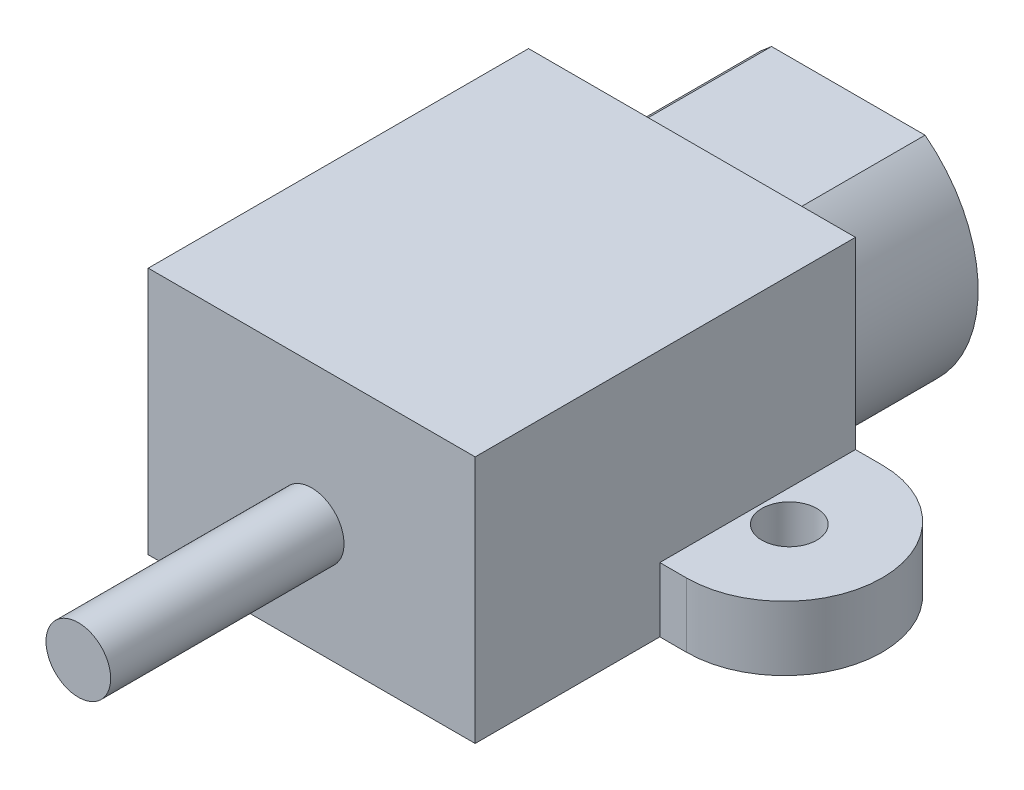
ISO-10303-21;
HEADER;
FILE_DESCRIPTION(('STEP AP214'),'2;1');
FILE_NAME('part.step','',(''),(''),'','','');
FILE_SCHEMA(('AUTOMOTIVE_DESIGN { 1 0 10303 214 1 1 1 1 }'));
ENDSEC;
DATA;
#1=APPLICATION_CONTEXT('core data for automotive mechanical design processes');
#2=APPLICATION_PROTOCOL_DEFINITION('international standard','automotive_design',2000,#1);
#3=PRODUCT_CONTEXT('',#1,'mechanical');
#4=PRODUCT('Part','Part','',(#3));
#5=PRODUCT_RELATED_PRODUCT_CATEGORY('part','',(#4));
#6=PRODUCT_DEFINITION_FORMATION('','',#4);
#7=PRODUCT_DEFINITION_CONTEXT('part definition',#1,'design');
#8=PRODUCT_DEFINITION('design','',#6,#7);
#9=PRODUCT_DEFINITION_SHAPE('','',#8);
#10=(LENGTH_UNIT() NAMED_UNIT(*) SI_UNIT(.MILLI.,.METRE.));
#11=(NAMED_UNIT(*) PLANE_ANGLE_UNIT() SI_UNIT($,.RADIAN.));
#12=(NAMED_UNIT(*) SI_UNIT($,.STERADIAN.) SOLID_ANGLE_UNIT());
#13=UNCERTAINTY_MEASURE_WITH_UNIT(LENGTH_MEASURE(1.E-05),#10,'distance_accuracy_value','');
#14=(GEOMETRIC_REPRESENTATION_CONTEXT(3) GLOBAL_UNCERTAINTY_ASSIGNED_CONTEXT((#13)) GLOBAL_UNIT_ASSIGNED_CONTEXT((#10,
#11,#12)) REPRESENTATION_CONTEXT('',''));
#15=CARTESIAN_POINT('',(0.,0.,0.));
#16=DIRECTION('',(0.,0.,1.));
#17=DIRECTION('',(1.,0.,0.));
#18=AXIS2_PLACEMENT_3D('',#15,#16,#17);
#19=CARTESIAN_POINT('',(-1.2319,2.9718,-17.5514));
#20=DIRECTION('',(0.,0.,1.));
#21=DIRECTION('',(1.,0.,0.));
#22=AXIS2_PLACEMENT_3D('',#19,#20,#21);
#23=PLANE('',#22);
#24=CARTESIAN_POINT('',(7.28262746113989,4.9657,-17.5514));
#25=DIRECTION('',(0.,0.,-1.));
#26=DIRECTION('',(1.,0.,0.));
#27=AXIS2_PLACEMENT_3D('',#24,#25,#26);
#28=CIRCLE('',#27,6.25557253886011);
#29=CARTESIAN_POINT('',(11.0871,9.9314,-17.5514));
#30=VERTEX_POINT('',#29);
#31=CARTESIAN_POINT('',(11.0871,0.,-17.5514));
#32=VERTEX_POINT('',#31);
#33=EDGE_CURVE('E51',#30,#32,#28,.T.);
#34=ORIENTED_EDGE('',*,*,#33,.F.);
#35=DIRECTION('',(1.,0.,0.));
#36=VECTOR('',#35,1.);
#37=CARTESIAN_POINT('',(11.0871,9.9314,-17.5514));
#38=LINE('',#37,#36);
#39=CARTESIAN_POINT('',(4.0005,9.9314,-17.5514));
#40=VERTEX_POINT('',#39);
#41=EDGE_CURVE('E55',#40,#30,#38,.T.);
#42=ORIENTED_EDGE('',*,*,#41,.F.);
#43=CARTESIAN_POINT('',(7.8049725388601,4.9657,-17.5514));
#44=DIRECTION('',(0.,0.,-1.));
#45=DIRECTION('',(1.,0.,0.));
#46=AXIS2_PLACEMENT_3D('',#43,#44,#45);
#47=CIRCLE('',#46,6.2555725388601);
#48=CARTESIAN_POINT('',(4.0005,0.,-17.5514));
#49=VERTEX_POINT('',#48);
#50=EDGE_CURVE('E490',#49,#40,#47,.T.);
#51=ORIENTED_EDGE('',*,*,#50,.F.);
#52=DIRECTION('',(-1.,0.,0.));
#53=VECTOR('',#52,1.);
#54=CARTESIAN_POINT('',(-1.2319,0.,-17.5514));
#55=LINE('',#54,#53);
#56=CARTESIAN_POINT('',(-1.2319,0.,-17.5514));
#57=VERTEX_POINT('',#56);
#58=EDGE_CURVE('E227',#49,#57,#55,.T.);
#59=ORIENTED_EDGE('',*,*,#58,.T.);
#60=DIRECTION('',(0.,-1.,0.));
#61=VECTOR('',#60,1.);
#62=CARTESIAN_POINT('',(-1.2319,2.9718,-17.5514));
#63=LINE('',#62,#61);
#64=CARTESIAN_POINT('',(-1.2319,2.9718,-17.5514));
#65=VERTEX_POINT('',#64);
#66=EDGE_CURVE('E238',#65,#57,#63,.T.);
#67=ORIENTED_EDGE('',*,*,#66,.F.);
#68=DIRECTION('',(-1.,0.,0.));
#69=VECTOR('',#68,1.);
#70=CARTESIAN_POINT('',(-1.2319,2.9718,-17.5514));
#71=LINE('',#70,#69);
#72=CARTESIAN_POINT('',(0.,2.9718,-17.5514));
#73=VERTEX_POINT('',#72);
#74=EDGE_CURVE('E209',#73,#65,#71,.T.);
#75=ORIENTED_EDGE('',*,*,#74,.F.);
#76=DIRECTION('',(0.,-1.,0.));
#77=VECTOR('',#76,1.);
#78=CARTESIAN_POINT('',(0.,46.0557198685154,-17.5514));
#79=LINE('',#78,#77);
#80=CARTESIAN_POINT('',(0.,11.4554,-17.5514));
#81=VERTEX_POINT('',#80);
#82=EDGE_CURVE('E181',#81,#73,#79,.T.);
#83=ORIENTED_EDGE('',*,*,#82,.F.);
#84=DIRECTION('',(-1.,0.,0.));
#85=VECTOR('',#84,1.);
#86=CARTESIAN_POINT('',(0.,11.4554,-17.5514));
#87=LINE('',#86,#85);
#88=CARTESIAN_POINT('',(15.0876,11.4554,-17.5514));
#89=VERTEX_POINT('',#88);
#90=EDGE_CURVE('E197',#89,#81,#87,.T.);
#91=ORIENTED_EDGE('',*,*,#90,.F.);
#92=DIRECTION('',(0.,-1.,0.));
#93=VECTOR('',#92,1.);
#94=CARTESIAN_POINT('',(15.0876,46.0557198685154,-17.5514));
#95=LINE('',#94,#93);
#96=CARTESIAN_POINT('',(15.0876,2.9718,-17.5514));
#97=VERTEX_POINT('',#96);
#98=EDGE_CURVE('E186',#89,#97,#95,.T.);
#99=ORIENTED_EDGE('',*,*,#98,.T.);
#100=CARTESIAN_POINT('',(16.3195,2.9718,-17.5514));
#101=VERTEX_POINT('',#100);
#102=EDGE_CURVE('E210',#101,#97,#71,.T.);
#103=ORIENTED_EDGE('',*,*,#102,.F.);
#104=DIRECTION('',(0.,-1.,0.));
#105=VECTOR('',#104,1.);
#106=CARTESIAN_POINT('',(16.3195,2.9718,-17.5514));
#107=LINE('',#106,#105);
#108=CARTESIAN_POINT('',(16.3195,0.,-17.5514));
#109=VERTEX_POINT('',#108);
#110=EDGE_CURVE('E241',#101,#109,#107,.T.);
#111=ORIENTED_EDGE('',*,*,#110,.T.);
#112=EDGE_CURVE('E228',#109,#32,#55,.T.);
#113=ORIENTED_EDGE('',*,*,#112,.T.);
#114=EDGE_LOOP('',(#34,#42,#51,#59,#67,#75,#83,#91,#99,#103,#111,#113));
#115=FACE_BOUND('',#114,.T.);
#116=ADVANCED_FACE('F35',(#115),#23,.F.);
#117=CARTESIAN_POINT('',(-1.2319,2.9718,-13.03655));
#118=DIRECTION('',(0.,1.,0.));
#119=DIRECTION('',(0.,0.,1.));
#120=AXIS2_PLACEMENT_3D('',#117,#118,#119);
#121=PLANE('',#120);
#122=CARTESIAN_POINT('',(-1.4605,2.9718,-13.03655));
#123=DIRECTION('',(0.,1.,0.));
#124=DIRECTION('',(0.,0.,1.));
#125=AXIS2_PLACEMENT_3D('',#122,#123,#124);
#126=CIRCLE('',#125,1.27);
#127=CARTESIAN_POINT('',(-1.4605,2.9718,-11.76655));
#128=VERTEX_POINT('',#127);
#129=EDGE_CURVE('E162',#128,#128,#126,.T.);
#130=ORIENTED_EDGE('',*,*,#129,.F.);
#131=EDGE_LOOP('',(#130));
#132=FACE_BOUND('',#131,.T.);
#133=DIRECTION('',(0.,0.,1.));
#134=VECTOR('',#133,1.);
#135=CARTESIAN_POINT('',(0.,2.9718,0.));
#136=LINE('',#135,#134);
#137=CARTESIAN_POINT('',(0.,2.9718,-8.5217));
#138=VERTEX_POINT('',#137);
#139=EDGE_CURVE('E183',#73,#138,#136,.T.);
#140=ORIENTED_EDGE('',*,*,#139,.F.);
#141=ORIENTED_EDGE('',*,*,#74,.T.);
#142=CARTESIAN_POINT('',(-1.2319,2.9718,-13.03655));
#143=DIRECTION('',(0.,1.,0.));
#144=DIRECTION('',(0.,0.,1.));
#145=AXIS2_PLACEMENT_3D('',#142,#143,#144);
#146=CIRCLE('',#145,4.51485000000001);
#147=CARTESIAN_POINT('',(-1.2319,2.9718,-8.52169999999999));
#148=VERTEX_POINT('',#147);
#149=EDGE_CURVE('E212',#65,#148,#146,.T.);
#150=ORIENTED_EDGE('',*,*,#149,.T.);
#151=DIRECTION('',(1.,0.,0.));
#152=VECTOR('',#151,1.);
#153=CARTESIAN_POINT('',(0.,2.9718,-8.5217));
#154=LINE('',#153,#152);
#155=EDGE_CURVE('E214',#148,#138,#154,.T.);
#156=ORIENTED_EDGE('',*,*,#155,.T.);
#157=EDGE_LOOP('',(#140,#141,#150,#156));
#158=FACE_BOUND('',#157,.T.);
#159=ADVANCED_FACE('F281',(#132,#158),#121,.T.);
#160=CARTESIAN_POINT('',(0.,2.9718,0.));
#161=DIRECTION('',(1.,0.,0.));
#162=DIRECTION('',(0.,0.,-1.));
#163=AXIS2_PLACEMENT_3D('',#160,#161,#162);
#164=PLANE('',#163);
#165=DIRECTION('',(0.,0.,1.));
#166=VECTOR('',#165,1.);
#167=CARTESIAN_POINT('',(0.,0.,0.));
#168=LINE('',#167,#166);
#169=CARTESIAN_POINT('',(0.,0.,-8.5217));
#170=VERTEX_POINT('',#169);
#171=CARTESIAN_POINT('',(0.,0.,0.));
#172=VERTEX_POINT('',#171);
#173=EDGE_CURVE('E190',#170,#172,#168,.T.);
#174=ORIENTED_EDGE('',*,*,#173,.T.);
#175=DIRECTION('',(0.,-1.,0.));
#176=VECTOR('',#175,1.);
#177=CARTESIAN_POINT('',(0.,2.9718,0.));
#178=LINE('',#177,#176);
#179=CARTESIAN_POINT('',(0.,11.4554,0.));
#180=VERTEX_POINT('',#179);
#181=EDGE_CURVE('E39',#180,#172,#178,.T.);
#182=ORIENTED_EDGE('',*,*,#181,.F.);
#183=DIRECTION('',(0.,0.,1.));
#184=VECTOR('',#183,1.);
#185=CARTESIAN_POINT('',(0.,11.4554,0.));
#186=LINE('',#185,#184);
#187=EDGE_CURVE('E194',#81,#180,#186,.T.);
#188=ORIENTED_EDGE('',*,*,#187,.F.);
#189=ORIENTED_EDGE('',*,*,#82,.T.);
#190=ORIENTED_EDGE('',*,*,#139,.T.);
#191=DIRECTION('',(0.,-1.,0.));
#192=VECTOR('',#191,1.);
#193=CARTESIAN_POINT('',(0.,2.9718,-8.5217));
#194=LINE('',#193,#192);
#195=EDGE_CURVE('E216',#138,#170,#194,.T.);
#196=ORIENTED_EDGE('',*,*,#195,.T.);
#197=EDGE_LOOP('',(#174,#182,#188,#189,#190,#196));
#198=FACE_BOUND('',#197,.T.);
#199=ADVANCED_FACE('F37',(#198),#164,.F.);
#200=CARTESIAN_POINT('',(0.,2.9718,0.));
#201=DIRECTION('',(0.,0.,-1.));
#202=DIRECTION('',(-1.,0.,0.));
#203=AXIS2_PLACEMENT_3D('',#200,#201,#202);
#204=PLANE('',#203);
#205=CARTESIAN_POINT('',(7.54380000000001,4.953,0.));
#206=DIRECTION('',(0.,0.,-1.));
#207=DIRECTION('',(-1.,0.,0.));
#208=AXIS2_PLACEMENT_3D('',#205,#206,#207);
#209=CIRCLE('',#208,1.49225);
#210=CARTESIAN_POINT('',(6.05155000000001,4.953,0.));
#211=VERTEX_POINT('',#210);
#212=EDGE_CURVE('E179',#211,#211,#209,.T.);
#213=ORIENTED_EDGE('',*,*,#212,.T.);
#214=EDGE_LOOP('',(#213));
#215=FACE_BOUND('',#214,.T.);
#216=DIRECTION('',(1.,0.,0.));
#217=VECTOR('',#216,1.);
#218=CARTESIAN_POINT('',(0.,0.,0.));
#219=LINE('',#218,#217);
#220=CARTESIAN_POINT('',(15.0876,0.,0.));
#221=VERTEX_POINT('',#220);
#222=EDGE_CURVE('E219',#172,#221,#219,.T.);
#223=ORIENTED_EDGE('',*,*,#222,.T.);
#224=DIRECTION('',(0.,-1.,0.));
#225=VECTOR('',#224,1.);
#226=CARTESIAN_POINT('',(15.0876,2.9718,0.));
#227=LINE('',#226,#225);
#228=CARTESIAN_POINT('',(15.0876,11.4554,0.));
#229=VERTEX_POINT('',#228);
#230=EDGE_CURVE('E249',#229,#221,#227,.T.);
#231=ORIENTED_EDGE('',*,*,#230,.F.);
#232=DIRECTION('',(1.,0.,0.));
#233=VECTOR('',#232,1.);
#234=CARTESIAN_POINT('',(0.,11.4554,0.));
#235=LINE('',#234,#233);
#236=EDGE_CURVE('E191',#180,#229,#235,.T.);
#237=ORIENTED_EDGE('',*,*,#236,.F.);
#238=ORIENTED_EDGE('',*,*,#181,.T.);
#239=EDGE_LOOP('',(#223,#231,#237,#238));
#240=FACE_BOUND('',#239,.T.);
#241=ADVANCED_FACE('F257',(#215,#240),#204,.F.);
#242=CARTESIAN_POINT('',(15.0876,2.9718,0.));
#243=DIRECTION('',(-1.,0.,0.));
#244=DIRECTION('',(0.,0.,1.));
#245=AXIS2_PLACEMENT_3D('',#242,#243,#244);
#246=PLANE('',#245);
#247=DIRECTION('',(0.,0.,-1.));
#248=VECTOR('',#247,1.);
#249=CARTESIAN_POINT('',(15.0876,0.,0.));
#250=LINE('',#249,#248);
#251=CARTESIAN_POINT('',(15.0876,0.,-8.5217));
#252=VERTEX_POINT('',#251);
#253=EDGE_CURVE('E221',#221,#252,#250,.T.);
#254=ORIENTED_EDGE('',*,*,#253,.T.);
#255=DIRECTION('',(0.,-1.,0.));
#256=VECTOR('',#255,1.);
#257=CARTESIAN_POINT('',(15.0876,2.9718,-8.5217));
#258=LINE('',#257,#256);
#259=CARTESIAN_POINT('',(15.0876,2.9718,-8.5217));
#260=VERTEX_POINT('',#259);
#261=EDGE_CURVE('E247',#260,#252,#258,.T.);
#262=ORIENTED_EDGE('',*,*,#261,.F.);
#263=DIRECTION('',(0.,0.,-1.));
#264=VECTOR('',#263,1.);
#265=CARTESIAN_POINT('',(15.0876,2.9718,0.));
#266=LINE('',#265,#264);
#267=EDGE_CURVE('E12',#260,#97,#266,.T.);
#268=ORIENTED_EDGE('',*,*,#267,.T.);
#269=ORIENTED_EDGE('',*,*,#98,.F.);
#270=DIRECTION('',(0.,0.,-1.));
#271=VECTOR('',#270,1.);
#272=CARTESIAN_POINT('',(15.0876,11.4554,0.));
#273=LINE('',#272,#271);
#274=EDGE_CURVE('E187',#229,#89,#273,.T.);
#275=ORIENTED_EDGE('',*,*,#274,.F.);
#276=ORIENTED_EDGE('',*,*,#230,.T.);
#277=EDGE_LOOP('',(#254,#262,#268,#269,#275,#276));
#278=FACE_BOUND('',#277,.T.);
#279=ADVANCED_FACE('F266',(#278),#246,.F.);
#280=CARTESIAN_POINT('',(16.3195,2.9718,-8.52169999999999));
#281=DIRECTION('',(0.,0.,-1.));
#282=DIRECTION('',(-1.,0.,0.));
#283=AXIS2_PLACEMENT_3D('',#280,#281,#282);
#284=PLANE('',#283);
#285=DIRECTION('',(1.,0.,0.));
#286=VECTOR('',#285,1.);
#287=CARTESIAN_POINT('',(16.3195,0.,-8.52169999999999));
#288=LINE('',#287,#286);
#289=CARTESIAN_POINT('',(16.3195,0.,-8.52169999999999));
#290=VERTEX_POINT('',#289);
#291=EDGE_CURVE('E223',#252,#290,#288,.T.);
#292=ORIENTED_EDGE('',*,*,#291,.T.);
#293=DIRECTION('',(0.,-1.,0.));
#294=VECTOR('',#293,1.);
#295=CARTESIAN_POINT('',(16.3195,2.9718,-8.52169999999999));
#296=LINE('',#295,#294);
#297=CARTESIAN_POINT('',(16.3195,2.9718,-8.52169999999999));
#298=VERTEX_POINT('',#297);
#299=EDGE_CURVE('E244',#298,#290,#296,.T.);
#300=ORIENTED_EDGE('',*,*,#299,.F.);
#301=DIRECTION('',(1.,0.,0.));
#302=VECTOR('',#301,1.);
#303=CARTESIAN_POINT('',(16.3195,2.9718,-8.52169999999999));
#304=LINE('',#303,#302);
#305=EDGE_CURVE('E204',#260,#298,#304,.T.);
#306=ORIENTED_EDGE('',*,*,#305,.F.);
#307=ORIENTED_EDGE('',*,*,#261,.T.);
#308=EDGE_LOOP('',(#292,#300,#306,#307));
#309=FACE_BOUND('',#308,.T.);
#310=ADVANCED_FACE('F269',(#309),#284,.F.);
#311=CARTESIAN_POINT('',(16.3195,2.9718,-13.03655));
#312=DIRECTION('',(0.,-1.,0.));
#313=DIRECTION('',(0.,0.,-1.));
#314=AXIS2_PLACEMENT_3D('',#311,#312,#313);
#315=CYLINDRICAL_SURFACE('',#314,4.51485000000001);
#316=CARTESIAN_POINT('',(16.3195,0.,-13.03655));
#317=DIRECTION('',(0.,1.,0.));
#318=DIRECTION('',(0.,0.,-1.));
#319=AXIS2_PLACEMENT_3D('',#316,#317,#318);
#320=CIRCLE('',#319,4.51485000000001);
#321=EDGE_CURVE('E225',#290,#109,#320,.T.);
#322=ORIENTED_EDGE('',*,*,#321,.T.);
#323=ORIENTED_EDGE('',*,*,#110,.F.);
#324=CARTESIAN_POINT('',(16.3195,2.9718,-13.03655));
#325=DIRECTION('',(0.,1.,0.));
#326=DIRECTION('',(0.,0.,-1.));
#327=AXIS2_PLACEMENT_3D('',#324,#325,#326);
#328=CIRCLE('',#327,4.51485000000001);
#329=EDGE_CURVE('E206',#298,#101,#328,.T.);
#330=ORIENTED_EDGE('',*,*,#329,.F.);
#331=ORIENTED_EDGE('',*,*,#299,.T.);
#332=EDGE_LOOP('',(#322,#323,#330,#331));
#333=FACE_BOUND('',#332,.T.);
#334=ADVANCED_FACE('F298',(#333),#315,.T.);
#335=CARTESIAN_POINT('',(-1.2319,2.9718,-13.03655));
#336=DIRECTION('',(0.,-1.,0.));
#337=DIRECTION('',(0.,0.,-1.));
#338=AXIS2_PLACEMENT_3D('',#335,#336,#337);
#339=CYLINDRICAL_SURFACE('',#338,4.51485000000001);
#340=CARTESIAN_POINT('',(-1.2319,0.,-13.03655));
#341=DIRECTION('',(0.,1.,0.));
#342=DIRECTION('',(0.,0.,1.));
#343=AXIS2_PLACEMENT_3D('',#340,#341,#342);
#344=CIRCLE('',#343,4.51485000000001);
#345=CARTESIAN_POINT('',(-1.2319,0.,-8.52169999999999));
#346=VERTEX_POINT('',#345);
#347=EDGE_CURVE('E230',#57,#346,#344,.T.);
#348=ORIENTED_EDGE('',*,*,#347,.T.);
#349=DIRECTION('',(0.,-1.,0.));
#350=VECTOR('',#349,1.);
#351=CARTESIAN_POINT('',(-1.2319,2.9718,-8.52169999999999));
#352=LINE('',#351,#350);
#353=EDGE_CURVE('E235',#148,#346,#352,.T.);
#354=ORIENTED_EDGE('',*,*,#353,.F.);
#355=ORIENTED_EDGE('',*,*,#149,.F.);
#356=ORIENTED_EDGE('',*,*,#66,.T.);
#357=EDGE_LOOP('',(#348,#354,#355,#356));
#358=FACE_BOUND('',#357,.T.);
#359=ADVANCED_FACE('F287',(#358),#339,.T.);
#360=CARTESIAN_POINT('',(0.,2.9718,-8.5217));
#361=DIRECTION('',(0.,0.,-1.));
#362=DIRECTION('',(-1.,0.,0.));
#363=AXIS2_PLACEMENT_3D('',#360,#361,#362);
#364=PLANE('',#363);
#365=DIRECTION('',(1.,0.,0.));
#366=VECTOR('',#365,1.);
#367=CARTESIAN_POINT('',(0.,0.,-8.5217));
#368=LINE('',#367,#366);
#369=EDGE_CURVE('E207',#346,#170,#368,.T.);
#370=ORIENTED_EDGE('',*,*,#369,.T.);
#371=ORIENTED_EDGE('',*,*,#195,.F.);
#372=ORIENTED_EDGE('',*,*,#155,.F.);
#373=ORIENTED_EDGE('',*,*,#353,.T.);
#374=EDGE_LOOP('',(#370,#371,#372,#373));
#375=FACE_BOUND('',#374,.T.);
#376=ADVANCED_FACE('F289',(#375),#364,.F.);
#377=CARTESIAN_POINT('',(16.5481,2.9718,-13.03655));
#378=DIRECTION('',(0.,1.,0.));
#379=DIRECTION('',(0.,0.,1.));
#380=AXIS2_PLACEMENT_3D('',#377,#378,#379);
#381=CIRCLE('',#380,1.27);
#382=CARTESIAN_POINT('',(16.5481,2.9718,-11.76655));
#383=VERTEX_POINT('',#382);
#384=EDGE_CURVE('E173',#383,#383,#381,.T.);
#385=ORIENTED_EDGE('',*,*,#384,.F.);
#386=EDGE_LOOP('',(#385));
#387=FACE_BOUND('',#386,.T.);
#388=ORIENTED_EDGE('',*,*,#267,.F.);
#389=ORIENTED_EDGE('',*,*,#305,.T.);
#390=ORIENTED_EDGE('',*,*,#329,.T.);
#391=ORIENTED_EDGE('',*,*,#102,.T.);
#392=EDGE_LOOP('',(#388,#389,#390,#391));
#393=FACE_BOUND('',#392,.T.);
#394=ADVANCED_FACE('F273',(#387,#393),#121,.T.);
#395=CARTESIAN_POINT('',(-1.2319,0.,-13.03655));
#396=DIRECTION('',(0.,1.,0.));
#397=DIRECTION('',(0.,0.,1.));
#398=AXIS2_PLACEMENT_3D('',#395,#396,#397);
#399=PLANE('',#398);
#400=CARTESIAN_POINT('',(-1.4605,0.,-13.03655));
#401=DIRECTION('',(0.,-1.,0.));
#402=DIRECTION('',(0.,0.,-1.));
#403=AXIS2_PLACEMENT_3D('',#400,#401,#402);
#404=CIRCLE('',#403,1.27);
#405=CARTESIAN_POINT('',(-1.4605,0.,-14.30655));
#406=VERTEX_POINT('',#405);
#407=EDGE_CURVE('E159',#406,#406,#404,.T.);
#408=ORIENTED_EDGE('',*,*,#407,.F.);
#409=EDGE_LOOP('',(#408));
#410=FACE_BOUND('',#409,.T.);
#411=CARTESIAN_POINT('',(16.5481,0.,-13.03655));
#412=DIRECTION('',(0.,-1.,0.));
#413=DIRECTION('',(0.,0.,-1.));
#414=AXIS2_PLACEMENT_3D('',#411,#412,#413);
#415=CIRCLE('',#414,1.27);
#416=CARTESIAN_POINT('',(16.5481,0.,-14.30655));
#417=VERTEX_POINT('',#416);
#418=EDGE_CURVE('E170',#417,#417,#415,.T.);
#419=ORIENTED_EDGE('',*,*,#418,.F.);
#420=EDGE_LOOP('',(#419));
#421=FACE_BOUND('',#420,.T.);
#422=ORIENTED_EDGE('',*,*,#173,.F.);
#423=ORIENTED_EDGE('',*,*,#369,.F.);
#424=ORIENTED_EDGE('',*,*,#347,.F.);
#425=ORIENTED_EDGE('',*,*,#58,.F.);
#426=DIRECTION('',(0.,0.,1.));
#427=VECTOR('',#426,1.);
#428=CARTESIAN_POINT('',(4.0005,0.,-24.765));
#429=LINE('',#428,#427);
#430=CARTESIAN_POINT('',(4.0005,0.,-24.765));
#431=VERTEX_POINT('',#430);
#432=EDGE_CURVE('E144',#431,#49,#429,.T.);
#433=ORIENTED_EDGE('',*,*,#432,.F.);
#434=DIRECTION('',(-1.,0.,0.));
#435=VECTOR('',#434,1.);
#436=CARTESIAN_POINT('',(4.0005,0.,-24.765));
#437=LINE('',#436,#435);
#438=CARTESIAN_POINT('',(11.0871,0.,-24.765));
#439=VERTEX_POINT('',#438);
#440=EDGE_CURVE('E136',#439,#431,#437,.T.);
#441=ORIENTED_EDGE('',*,*,#440,.F.);
#442=DIRECTION('',(0.,0.,1.));
#443=VECTOR('',#442,1.);
#444=CARTESIAN_POINT('',(11.0871,0.,-24.765));
#445=LINE('',#444,#443);
#446=EDGE_CURVE('E142',#439,#32,#445,.T.);
#447=ORIENTED_EDGE('',*,*,#446,.T.);
#448=ORIENTED_EDGE('',*,*,#112,.F.);
#449=ORIENTED_EDGE('',*,*,#321,.F.);
#450=ORIENTED_EDGE('',*,*,#291,.F.);
#451=ORIENTED_EDGE('',*,*,#253,.F.);
#452=ORIENTED_EDGE('',*,*,#222,.F.);
#453=EDGE_LOOP('',(#422,#423,#424,#425,#433,#441,#447,#448,#449,#450,#451,#452));
#454=FACE_BOUND('',#453,.T.);
#455=ADVANCED_FACE('F139',(#410,#421,#454),#399,.F.);
#456=CARTESIAN_POINT('',(-1.2319,11.4554,-13.03655));
#457=DIRECTION('',(0.,1.,0.));
#458=DIRECTION('',(0.,0.,1.));
#459=AXIS2_PLACEMENT_3D('',#456,#457,#458);
#460=PLANE('',#459);
#461=ORIENTED_EDGE('',*,*,#90,.T.);
#462=ORIENTED_EDGE('',*,*,#187,.T.);
#463=ORIENTED_EDGE('',*,*,#236,.T.);
#464=ORIENTED_EDGE('',*,*,#274,.T.);
#465=EDGE_LOOP('',(#461,#462,#463,#464));
#466=FACE_BOUND('',#465,.T.);
#467=ADVANCED_FACE('F279',(#466),#460,.T.);
#468=CARTESIAN_POINT('',(7.54380000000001,4.953,25.7599203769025));
#469=DIRECTION('',(0.,0.,-1.));
#470=DIRECTION('',(-1.,0.,0.));
#471=AXIS2_PLACEMENT_3D('',#468,#469,#470);
#472=CYLINDRICAL_SURFACE('',#471,1.49225);
#473=CARTESIAN_POINT('',(7.54380000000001,4.953,10.7696));
#474=DIRECTION('',(0.,0.,-1.));
#475=DIRECTION('',(-1.,0.,0.));
#476=AXIS2_PLACEMENT_3D('',#473,#474,#475);
#477=CIRCLE('',#476,1.49225);
#478=CARTESIAN_POINT('',(6.05155000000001,4.953,10.7696));
#479=VERTEX_POINT('',#478);
#480=EDGE_CURVE('E176',#479,#479,#477,.F.);
#481=ORIENTED_EDGE('',*,*,#480,.F.);
#482=EDGE_LOOP('',(#481));
#483=FACE_BOUND('',#482,.T.);
#484=ORIENTED_EDGE('',*,*,#212,.F.);
#485=EDGE_LOOP('',(#484));
#486=FACE_BOUND('',#485,.T.);
#487=ADVANCED_FACE('F323',(#483,#486),#472,.T.);
#488=CARTESIAN_POINT('',(0.,2.9718,10.7696));
#489=DIRECTION('',(0.,0.,-1.));
#490=DIRECTION('',(-1.,0.,0.));
#491=AXIS2_PLACEMENT_3D('',#488,#489,#490);
#492=PLANE('',#491);
#493=ORIENTED_EDGE('',*,*,#480,.T.);
#494=EDGE_LOOP('',(#493));
#495=FACE_BOUND('',#494,.T.);
#496=ADVANCED_FACE('F325',(#495),#492,.F.);
#497=CARTESIAN_POINT('',(16.5481,11.4554,-13.03655));
#498=DIRECTION('',(0.,-1.,0.));
#499=DIRECTION('',(0.,0.,-1.));
#500=AXIS2_PLACEMENT_3D('',#497,#498,#499);
#501=CYLINDRICAL_SURFACE('',#500,1.27);
#502=ORIENTED_EDGE('',*,*,#384,.T.);
#503=EDGE_LOOP('',(#502));
#504=FACE_BOUND('',#503,.T.);
#505=ORIENTED_EDGE('',*,*,#418,.T.);
#506=EDGE_LOOP('',(#505));
#507=FACE_BOUND('',#506,.T.);
#508=ADVANCED_FACE('F332',(#504,#507),#501,.F.);
#509=CARTESIAN_POINT('',(-1.4605,11.4554,-13.03655));
#510=DIRECTION('',(0.,-1.,0.));
#511=DIRECTION('',(0.,0.,-1.));
#512=AXIS2_PLACEMENT_3D('',#509,#510,#511);
#513=CYLINDRICAL_SURFACE('',#512,1.27);
#514=ORIENTED_EDGE('',*,*,#129,.T.);
#515=EDGE_LOOP('',(#514));
#516=FACE_BOUND('',#515,.T.);
#517=ORIENTED_EDGE('',*,*,#407,.T.);
#518=EDGE_LOOP('',(#517));
#519=FACE_BOUND('',#518,.T.);
#520=ADVANCED_FACE('F348',(#516,#519),#513,.F.);
#521=CARTESIAN_POINT('',(7.28262746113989,4.9657,-24.765));
#522=DIRECTION('',(0.,0.,1.));
#523=DIRECTION('',(1.,0.,0.));
#524=AXIS2_PLACEMENT_3D('',#521,#522,#523);
#525=CYLINDRICAL_SURFACE('',#524,6.25557253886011);
#526=ORIENTED_EDGE('',*,*,#33,.T.);
#527=ORIENTED_EDGE('',*,*,#446,.F.);
#528=CARTESIAN_POINT('',(7.28262746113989,4.9657,-24.765));
#529=DIRECTION('',(0.,0.,-1.));
#530=DIRECTION('',(1.,0.,0.));
#531=AXIS2_PLACEMENT_3D('',#528,#529,#530);
#532=CIRCLE('',#531,6.25557253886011);
#533=CARTESIAN_POINT('',(11.0871,9.9314,-24.765));
#534=VERTEX_POINT('',#533);
#535=EDGE_CURVE('E148',#534,#439,#532,.T.);
#536=ORIENTED_EDGE('',*,*,#535,.F.);
#537=DIRECTION('',(0.,0.,1.));
#538=VECTOR('',#537,1.);
#539=CARTESIAN_POINT('',(11.0871,9.9314,-24.765));
#540=LINE('',#539,#538);
#541=EDGE_CURVE('E488',#534,#30,#540,.T.);
#542=ORIENTED_EDGE('',*,*,#541,.T.);
#543=EDGE_LOOP('',(#526,#527,#536,#542));
#544=FACE_BOUND('',#543,.T.);
#545=ADVANCED_FACE('F158',(#544),#525,.T.);
#546=CARTESIAN_POINT('',(7.8049725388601,4.9657,-24.765));
#547=DIRECTION('',(0.,0.,1.));
#548=DIRECTION('',(1.,0.,0.));
#549=AXIS2_PLACEMENT_3D('',#546,#547,#548);
#550=CYLINDRICAL_SURFACE('',#549,6.2555725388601);
#551=ORIENTED_EDGE('',*,*,#50,.T.);
#552=DIRECTION('',(0.,0.,1.));
#553=VECTOR('',#552,1.);
#554=CARTESIAN_POINT('',(4.0005,9.9314,-24.765));
#555=LINE('',#554,#553);
#556=CARTESIAN_POINT('',(4.0005,9.9314,-24.765));
#557=VERTEX_POINT('',#556);
#558=EDGE_CURVE('E164',#557,#40,#555,.T.);
#559=ORIENTED_EDGE('',*,*,#558,.F.);
#560=CARTESIAN_POINT('',(7.8049725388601,4.9657,-24.765));
#561=DIRECTION('',(0.,0.,-1.));
#562=DIRECTION('',(1.,0.,0.));
#563=AXIS2_PLACEMENT_3D('',#560,#561,#562);
#564=CIRCLE('',#563,6.2555725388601);
#565=EDGE_CURVE('E147',#431,#557,#564,.T.);
#566=ORIENTED_EDGE('',*,*,#565,.F.);
#567=ORIENTED_EDGE('',*,*,#432,.T.);
#568=EDGE_LOOP('',(#551,#559,#566,#567));
#569=FACE_BOUND('',#568,.T.);
#570=ADVANCED_FACE('F357',(#569),#550,.T.);
#571=CARTESIAN_POINT('',(11.0871,9.9314,-24.765));
#572=DIRECTION('',(0.,-1.,0.));
#573=DIRECTION('',(0.,0.,-1.));
#574=AXIS2_PLACEMENT_3D('',#571,#572,#573);
#575=PLANE('',#574);
#576=ORIENTED_EDGE('',*,*,#41,.T.);
#577=ORIENTED_EDGE('',*,*,#541,.F.);
#578=DIRECTION('',(1.,0.,0.));
#579=VECTOR('',#578,1.);
#580=CARTESIAN_POINT('',(11.0871,9.9314,-24.765));
#581=LINE('',#580,#579);
#582=EDGE_CURVE('E153',#557,#534,#581,.T.);
#583=ORIENTED_EDGE('',*,*,#582,.F.);
#584=ORIENTED_EDGE('',*,*,#558,.T.);
#585=EDGE_LOOP('',(#576,#577,#583,#584));
#586=FACE_BOUND('',#585,.T.);
#587=ADVANCED_FACE('F360',(#586),#575,.F.);
#588=CARTESIAN_POINT('',(7.28262746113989,4.9657,-24.765));
#589=DIRECTION('',(0.,0.,1.));
#590=DIRECTION('',(1.,0.,0.));
#591=AXIS2_PLACEMENT_3D('',#588,#589,#590);
#592=PLANE('',#591);
#593=ORIENTED_EDGE('',*,*,#535,.T.);
#594=ORIENTED_EDGE('',*,*,#440,.T.);
#595=ORIENTED_EDGE('',*,*,#565,.T.);
#596=ORIENTED_EDGE('',*,*,#582,.T.);
#597=EDGE_LOOP('',(#593,#594,#595,#596));
#598=FACE_BOUND('',#597,.T.);
#599=ADVANCED_FACE('F151',(#598),#592,.F.);
#600=CLOSED_SHELL('',(#116,#159,#199,#241,#279,#310,#334,#359,#376,#394,#455,#467,#487,#496,
#508,#520,#545,#570,#587,#599));
#601=MANIFOLD_SOLID_BREP('B2',#600);
#602=ADVANCED_BREP_SHAPE_REPRESENTATION('',(#18,#601),#14);
#603=SHAPE_DEFINITION_REPRESENTATION(#9,#602);
ENDSEC;
END-ISO-10303-21;
